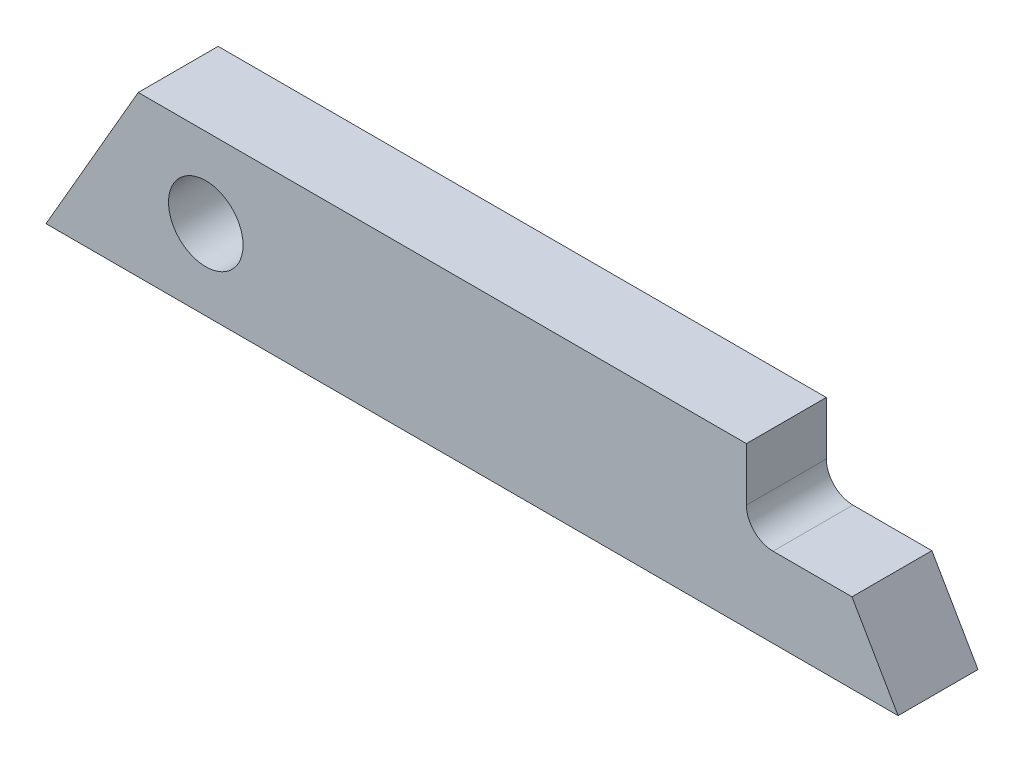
from build123d import *

# Parameters (mm, degrees)
AUFSATZ_LINEAR_AUSTRAGEN1_DEPTH      = 15
F_14_0_14_DURCHMESSER_BOHRUNG1_D     = 14
F_14_0_14_DURCHMESSER_BOHRUNG1_DEPTH = 15
F_14_0_14_DURCHMESSER_BOHRUNG1_TIP   = 4.206024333


with BuildPart() as part:
    # Skizze1 → Aufsatz-Linear austragen1 (new body)
    with BuildSketch(Plane.XY):
        Polygon((17.320508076, 30), (0, 0), (160, 0), (151.339745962, 15), (136.514794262, 15), (131.514794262, 15), (131.514794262, 20), (131.514794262, 30), align=None)
        with BuildLine():
            Line((131.514794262, 15), (136.514794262, 15))
            ThreePointArc((136.514794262, 15), (132.979260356, 16.464466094), (131.514794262, 20))
            Line((131.514794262, 20), (131.514794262, 15))
        make_face()
    extrude(amount=AUFSATZ_LINEAR_AUSTRAGEN1_DEPTH)

    # 14.0 _14_ Durchmesser Bohrung1
    with Locations(Plane.XY.offset(15)):
        with Locations((30, 15)):
            Hole(F_14_0_14_DURCHMESSER_BOHRUNG1_D / 2, depth=F_14_0_14_DURCHMESSER_BOHRUNG1_DEPTH)
            with Locations((0, 0, -(F_14_0_14_DURCHMESSER_BOHRUNG1_DEPTH + F_14_0_14_DURCHMESSER_BOHRUNG1_TIP / 2))):  # 118° drill point
                Cone(0, F_14_0_14_DURCHMESSER_BOHRUNG1_D / 2, F_14_0_14_DURCHMESSER_BOHRUNG1_TIP, mode=Mode.SUBTRACT)


solid = part.part
